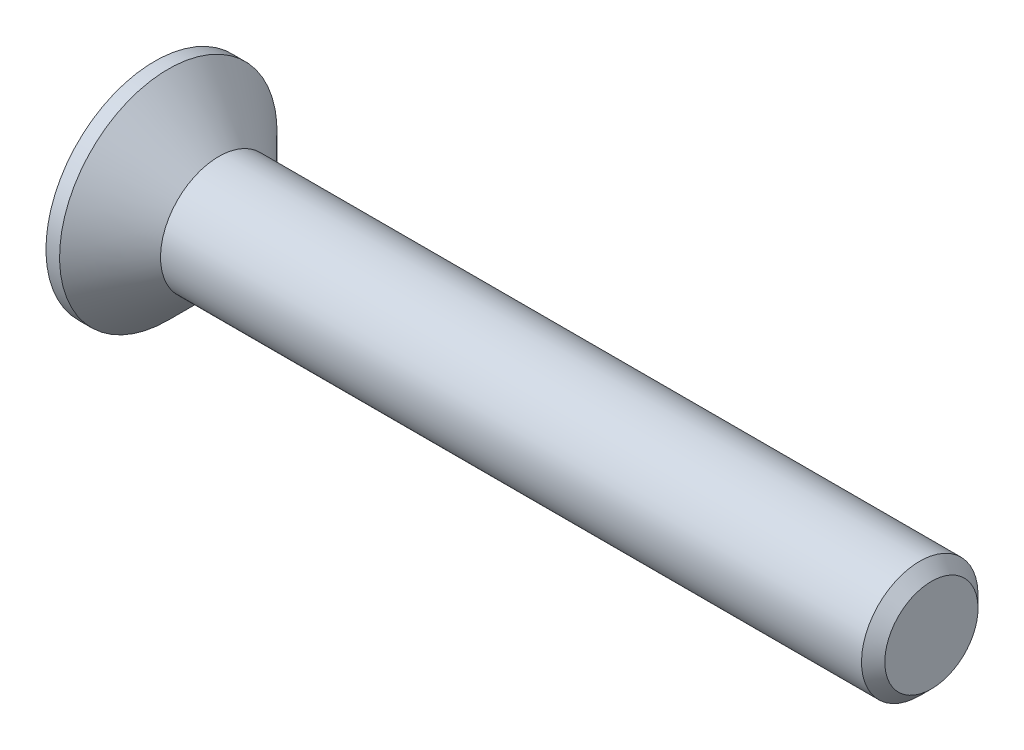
from build123d import *

# Parameters (mm, degrees)
CHAMFER1_SIZE      = 0.3
CUT_EXTRUDE1_DEPTH = 1.25


with BuildPart() as part:
    # Sketch1 → Revolve1 (revolve)
    with BuildSketch(Plane.XY, mode=Mode.PRIVATE) as revolve1_sk:
        Polygon((-1.65, 2.8), (-1.65, 0), (18.35, 0), (18.35, 1.5), (0, 1.5), (-1.3, 2.8), align=None)
    revolve(revolve1_sk.sketch.rotate(Axis((-1.65, 0, 0), (1, 0, 0)), 180), axis=Axis((-1.65, 0, 0), (1, 0, 0)))

    # Chamfer1
    chamfer1_edges = [part.edges().sort_by_distance(p)[0] for p in [
        (18.35, 1.5, 0),
    ]]
    chamfer(chamfer1_edges, length=CHAMFER1_SIZE)

    # Sketch2 → Cut-Extrude1 (cut)
    with BuildSketch(Plane.ZY.offset(1.65)):
        Polygon((-0.365, 1.45), (0.365, 1.45), (0.365, 0.365), (1.45, 0.365), (1.45, -0.365), (0.365, -0.365), (0.365, -1.45), (-0.365, -1.45), (-0.365, -0.365), (-1.45, -0.365), (-1.45, 0.365), (-0.365, 0.365), align=None)
    extrude(amount=-CUT_EXTRUDE1_DEPTH, mode=Mode.SUBTRACT)


solid = part.part
